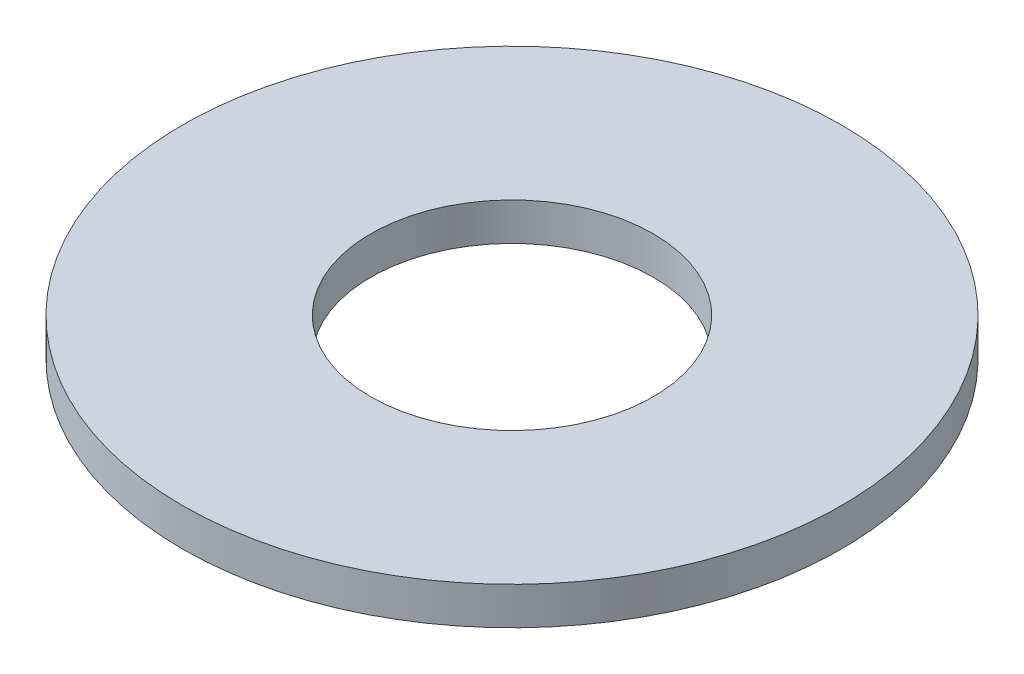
ISO-10303-21;
HEADER;
FILE_DESCRIPTION(('STEP AP214'),'2;1');
FILE_NAME('part.step','',(''),(''),'','','');
FILE_SCHEMA(('AUTOMOTIVE_DESIGN { 1 0 10303 214 1 1 1 1 }'));
ENDSEC;
DATA;
#1=APPLICATION_CONTEXT('core data for automotive mechanical design processes');
#2=APPLICATION_PROTOCOL_DEFINITION('international standard','automotive_design',2000,#1);
#3=PRODUCT_CONTEXT('',#1,'mechanical');
#4=PRODUCT('Part','Part','',(#3));
#5=PRODUCT_RELATED_PRODUCT_CATEGORY('part','',(#4));
#6=PRODUCT_DEFINITION_FORMATION('','',#4);
#7=PRODUCT_DEFINITION_CONTEXT('part definition',#1,'design');
#8=PRODUCT_DEFINITION('design','',#6,#7);
#9=PRODUCT_DEFINITION_SHAPE('','',#8);
#10=(LENGTH_UNIT() NAMED_UNIT(*) SI_UNIT(.MILLI.,.METRE.));
#11=(NAMED_UNIT(*) PLANE_ANGLE_UNIT() SI_UNIT($,.RADIAN.));
#12=(NAMED_UNIT(*) SI_UNIT($,.STERADIAN.) SOLID_ANGLE_UNIT());
#13=UNCERTAINTY_MEASURE_WITH_UNIT(LENGTH_MEASURE(1.E-05),#10,'distance_accuracy_value','');
#14=(GEOMETRIC_REPRESENTATION_CONTEXT(3) GLOBAL_UNCERTAINTY_ASSIGNED_CONTEXT((#13)) GLOBAL_UNIT_ASSIGNED_CONTEXT((#10,
#11,#12)) REPRESENTATION_CONTEXT('',''));
#15=CARTESIAN_POINT('',(0.,0.,0.));
#16=DIRECTION('',(0.,0.,1.));
#17=DIRECTION('',(1.,0.,0.));
#18=AXIS2_PLACEMENT_3D('',#15,#16,#17);
#19=CARTESIAN_POINT('',(0.,2.54,0.));
#20=DIRECTION('',(0.,1.,0.));
#21=DIRECTION('',(0.,0.,1.));
#22=AXIS2_PLACEMENT_3D('',#19,#20,#21);
#23=PLANE('',#22);
#24=CARTESIAN_POINT('',(0.,2.54,0.));
#25=DIRECTION('',(0.,1.,0.));
#26=DIRECTION('',(0.,0.,1.));
#27=AXIS2_PLACEMENT_3D('',#24,#25,#26);
#28=CIRCLE('',#27,22.225);
#29=CARTESIAN_POINT('',(0.,2.54,22.225));
#30=VERTEX_POINT('',#29);
#31=EDGE_CURVE('E10',#30,#30,#28,.T.);
#32=ORIENTED_EDGE('',*,*,#31,.T.);
#33=EDGE_LOOP('',(#32));
#34=FACE_BOUND('',#33,.T.);
#35=CARTESIAN_POINT('',(0.,2.54,0.));
#36=DIRECTION('',(0.,1.,0.));
#37=DIRECTION('',(0.,0.,1.));
#38=AXIS2_PLACEMENT_3D('',#35,#36,#37);
#39=CIRCLE('',#38,9.525);
#40=CARTESIAN_POINT('',(0.,2.54,9.525));
#41=VERTEX_POINT('',#40);
#42=EDGE_CURVE('E42',#41,#41,#39,.T.);
#43=ORIENTED_EDGE('',*,*,#42,.F.);
#44=EDGE_LOOP('',(#43));
#45=FACE_BOUND('',#44,.T.);
#46=ADVANCED_FACE('F31',(#34,#45),#23,.T.);
#47=CARTESIAN_POINT('',(0.,0.,0.));
#48=DIRECTION('',(0.,1.,0.));
#49=DIRECTION('',(0.,0.,1.));
#50=AXIS2_PLACEMENT_3D('',#47,#48,#49);
#51=PLANE('',#50);
#52=CARTESIAN_POINT('',(0.,0.,0.));
#53=DIRECTION('',(0.,1.,0.));
#54=DIRECTION('',(0.,0.,1.));
#55=AXIS2_PLACEMENT_3D('',#52,#53,#54);
#56=CIRCLE('',#55,22.225);
#57=CARTESIAN_POINT('',(0.,0.,22.225));
#58=VERTEX_POINT('',#57);
#59=EDGE_CURVE('E35',#58,#58,#56,.T.);
#60=ORIENTED_EDGE('',*,*,#59,.F.);
#61=EDGE_LOOP('',(#60));
#62=FACE_BOUND('',#61,.T.);
#63=CARTESIAN_POINT('',(0.,0.,0.));
#64=DIRECTION('',(0.,1.,0.));
#65=DIRECTION('',(0.,0.,1.));
#66=AXIS2_PLACEMENT_3D('',#63,#64,#65);
#67=CIRCLE('',#66,9.525);
#68=CARTESIAN_POINT('',(0.,0.,9.525));
#69=VERTEX_POINT('',#68);
#70=EDGE_CURVE('E44',#69,#69,#67,.T.);
#71=ORIENTED_EDGE('',*,*,#70,.T.);
#72=EDGE_LOOP('',(#71));
#73=FACE_BOUND('',#72,.T.);
#74=ADVANCED_FACE('F54',(#62,#73),#51,.F.);
#75=CARTESIAN_POINT('',(0.,2.54,0.));
#76=DIRECTION('',(0.,-1.,0.));
#77=DIRECTION('',(0.,0.,-1.));
#78=AXIS2_PLACEMENT_3D('',#75,#76,#77);
#79=CYLINDRICAL_SURFACE('',#78,22.225);
#80=ORIENTED_EDGE('',*,*,#31,.F.);
#81=EDGE_LOOP('',(#80));
#82=FACE_BOUND('',#81,.T.);
#83=ORIENTED_EDGE('',*,*,#59,.T.);
#84=EDGE_LOOP('',(#83));
#85=FACE_BOUND('',#84,.T.);
#86=ADVANCED_FACE('F33',(#82,#85),#79,.T.);
#87=CARTESIAN_POINT('',(0.,2.54,0.));
#88=DIRECTION('',(0.,-1.,0.));
#89=DIRECTION('',(0.,0.,-1.));
#90=AXIS2_PLACEMENT_3D('',#87,#88,#89);
#91=CYLINDRICAL_SURFACE('',#90,9.525);
#92=ORIENTED_EDGE('',*,*,#42,.T.);
#93=EDGE_LOOP('',(#92));
#94=FACE_BOUND('',#93,.T.);
#95=ORIENTED_EDGE('',*,*,#70,.F.);
#96=EDGE_LOOP('',(#95));
#97=FACE_BOUND('',#96,.T.);
#98=ADVANCED_FACE('F50',(#94,#97),#91,.F.);
#99=CLOSED_SHELL('',(#46,#74,#86,#98));
#100=MANIFOLD_SOLID_BREP('B2',#99);
#101=ADVANCED_BREP_SHAPE_REPRESENTATION('',(#18,#100),#14);
#102=SHAPE_DEFINITION_REPRESENTATION(#9,#101);
ENDSEC;
END-ISO-10303-21;
